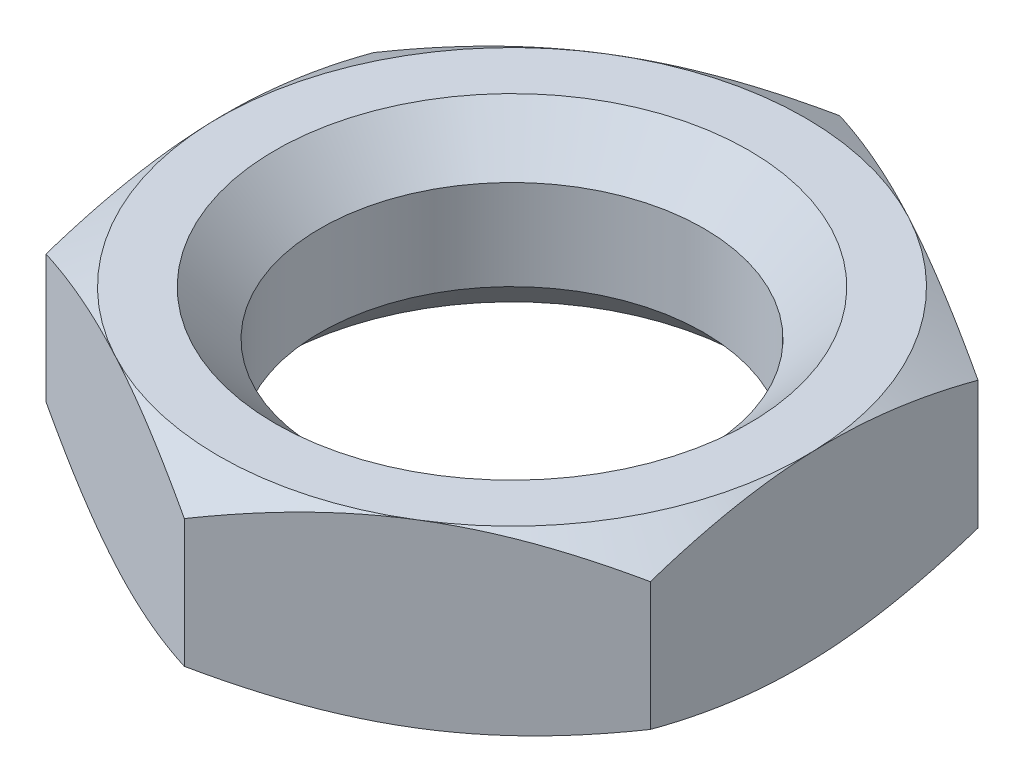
from build123d import *

# Parameters (mm, degrees)
EXTRUDE1_DEPTH         = 4
M10X1_5_TAPPED_HOLE7_D = 8.5
CHAMFER1_SIZE          = 1


with BuildPart() as part:
    # Sketch1 → Extrude1 (new body)
    with BuildSketch(Plane(origin=(0, 0, 0), x_dir=(1, 0, 0), z_dir=(0, 1, 0))):
        Polygon((6.378990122, 3.954973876), (-0.235612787, 7.501854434), (-6.614602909, 3.546880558), (-6.378990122, -3.954973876), (0.235612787, -7.501854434), (6.614602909, -3.546880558), align=None)
    extrude(amount=EXTRUDE1_DEPTH)

    # M10x1.5 Tapped Hole7 (through all)
    with Locations(Plane.ZX.offset(4)):
        with Locations((0, 0)):
            Hole(M10X1_5_TAPPED_HOLE7_D / 2)

    # Chamfer1
    chamfer1_edges = [part.edges().sort_by_distance(p)[0] for p in [
        (0, 4, 4.25),
        (0, 0, 4.25),
    ]]
    chamfer(chamfer1_edges, length=CHAMFER1_SIZE)

    # Sketch13 → Cut-Revolve1 (revolve, cut)
    with BuildSketch(Plane(origin=(0, 0, 0), x_dir=(-0.9995071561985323, 0, 0.03139179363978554), z_dir=(-0.03139179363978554, 0, -0.9995071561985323))):
        Polygon((-6.5, 4), (-9.5, 4), (-9.5, 2.267949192), align=None)
        Polygon((-6.5, 0), (-9.5, 0), (-9.5, 1.732050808), align=None)
    revolve(axis=Axis((0, 2.267949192, 0), (0, 1, 0)), mode=Mode.SUBTRACT)


solid = part.part
